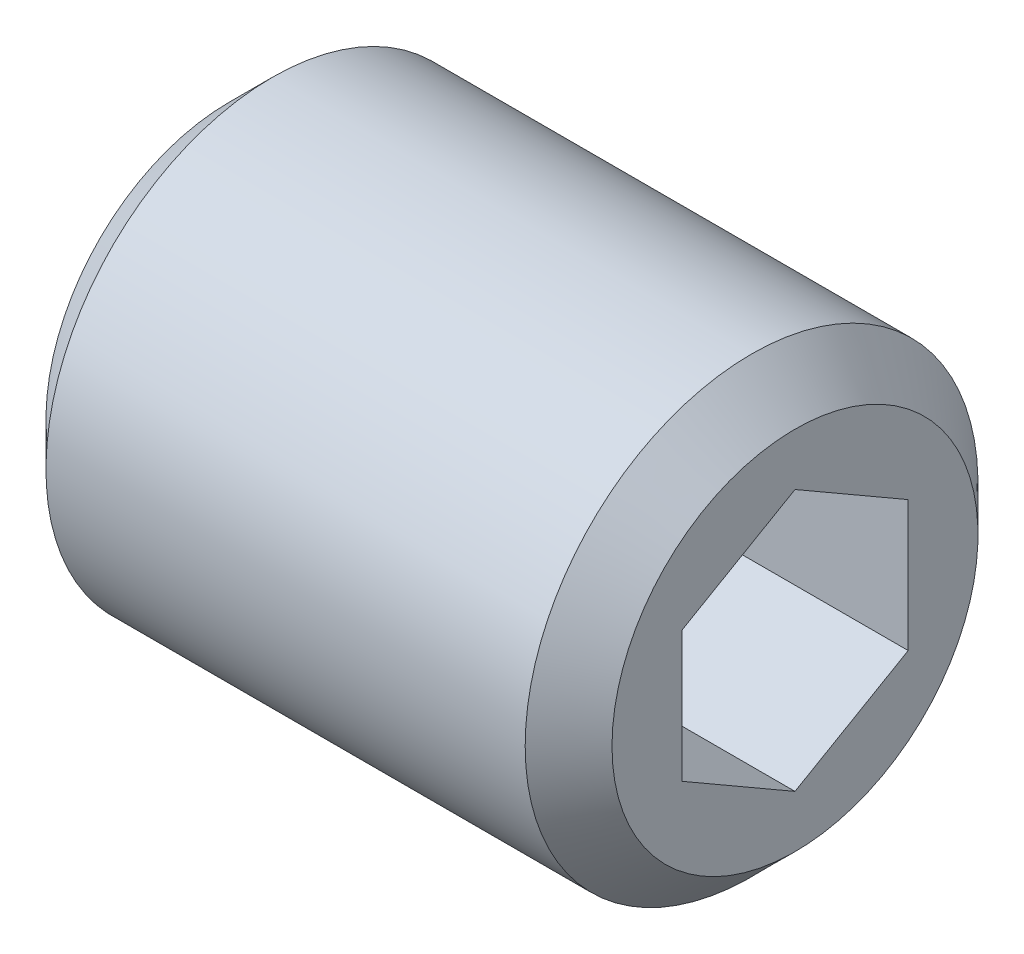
ISO-10303-21;
HEADER;
FILE_DESCRIPTION(('STEP AP214'),'2;1');
FILE_NAME('part.step','',(''),(''),'','','');
FILE_SCHEMA(('AUTOMOTIVE_DESIGN { 1 0 10303 214 1 1 1 1 }'));
ENDSEC;
DATA;
#1=APPLICATION_CONTEXT('core data for automotive mechanical design processes');
#2=APPLICATION_PROTOCOL_DEFINITION('international standard','automotive_design',2000,#1);
#3=PRODUCT_CONTEXT('',#1,'mechanical');
#4=PRODUCT('Part','Part','',(#3));
#5=PRODUCT_RELATED_PRODUCT_CATEGORY('part','',(#4));
#6=PRODUCT_DEFINITION_FORMATION('','',#4);
#7=PRODUCT_DEFINITION_CONTEXT('part definition',#1,'design');
#8=PRODUCT_DEFINITION('design','',#6,#7);
#9=PRODUCT_DEFINITION_SHAPE('','',#8);
#10=(LENGTH_UNIT() NAMED_UNIT(*) SI_UNIT(.MILLI.,.METRE.));
#11=(NAMED_UNIT(*) PLANE_ANGLE_UNIT() SI_UNIT($,.RADIAN.));
#12=(NAMED_UNIT(*) SI_UNIT($,.STERADIAN.) SOLID_ANGLE_UNIT());
#13=UNCERTAINTY_MEASURE_WITH_UNIT(LENGTH_MEASURE(1.E-05),#10,'distance_accuracy_value','');
#14=(GEOMETRIC_REPRESENTATION_CONTEXT(3) GLOBAL_UNCERTAINTY_ASSIGNED_CONTEXT((#13)) GLOBAL_UNIT_ASSIGNED_CONTEXT((#10,
#11,#12)) REPRESENTATION_CONTEXT('',''));
#15=CARTESIAN_POINT('',(0.,0.,0.));
#16=DIRECTION('',(0.,0.,1.));
#17=DIRECTION('',(1.,0.,0.));
#18=AXIS2_PLACEMENT_3D('',#15,#16,#17);
#19=CARTESIAN_POINT('',(5.00800000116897,0.,0.));
#20=DIRECTION('',(1.,0.,0.));
#21=DIRECTION('',(0.,0.,-1.));
#22=AXIS2_PLACEMENT_3D('',#19,#20,#21);
#23=CONICAL_SURFACE('',#22,2.32325748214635,1.04719754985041);
#24=CARTESIAN_POINT('',(3.66666666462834,-1.70530256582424E-10,0.));
#25=VERTEX_POINT('',#24);
#26=VERTEX_LOOP('',#25);
#27=FACE_BOUND('',#26,.T.);
#28=CARTESIAN_POINT('',(5.00000000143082,-1.15470053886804,1.99999999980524));
#29=CARTESIAN_POINT('',(4.97069554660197,-1.20544263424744,1.9121121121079));
#30=CARTESIAN_POINT('',(4.94404467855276,-1.25662273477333,1.82346557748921));
#31=CARTESIAN_POINT('',(4.897526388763,-1.35986908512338,1.64463765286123));
#32=CARTESIAN_POINT('',(4.87767542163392,-1.41193716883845,1.55445308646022));
#33=CARTESIAN_POINT('',(4.84677596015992,-1.51542808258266,1.3752015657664));
#34=CARTESIAN_POINT('',(4.83552178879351,-1.56683499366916,1.2861621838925));
#35=CARTESIAN_POINT('',(4.82208916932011,-1.66989057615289,1.10766467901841));
#36=CARTESIAN_POINT('',(4.81989959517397,-1.72153887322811,1.01820720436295));
#37=CARTESIAN_POINT('',(4.82446629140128,-1.81803817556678,0.851065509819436));
#38=CARTESIAN_POINT('',(4.83010128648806,-1.86290366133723,0.773356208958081));
#39=CARTESIAN_POINT('',(4.84795730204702,-1.95234234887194,0.618443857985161));
#40=CARTESIAN_POINT('',(4.86018441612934,-1.99691524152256,0.541241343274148));
#41=CARTESIAN_POINT('',(4.89074983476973,-2.08653818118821,0.386009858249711));
#42=CARTESIAN_POINT('',(4.90921764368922,-2.13157689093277,0.308000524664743));
#43=CARTESIAN_POINT('',(4.95113176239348,-2.22098275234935,0.153145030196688));
#44=CARTESIAN_POINT('',(4.97456823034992,-2.26535104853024,0.0762968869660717));
#45=CARTESIAN_POINT('',(5.00000000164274,-2.30940107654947,3.62011573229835E-10));
#46=B_SPLINE_CURVE_WITH_KNOTS('',3,(#28,#29,#30,#31,#32,#33,#34,#35,#36,#37,#38,#39,#40,#41,#42,
#43,#44,#45),.UNSPECIFIED.,.F.,.F.,(4,2,2,2,2,2,2,2,4),(0.,0.317016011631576,0.634793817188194,
0.944707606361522,1.25424088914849,1.5237077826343,1.7934241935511,2.06912162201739,
2.34427797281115),.UNSPECIFIED.);
#47=CARTESIAN_POINT('',(5.00000000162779,-1.15470053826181,1.99999999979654));
#48=VERTEX_POINT('',#47);
#49=CARTESIAN_POINT('',(5.0000000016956,-2.30940107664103,2.03426577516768E-10));
#50=VERTEX_POINT('',#49);
#51=EDGE_CURVE('E20',#48,#50,#46,.T.);
#52=ORIENTED_EDGE('',*,*,#51,.T.);
#53=CARTESIAN_POINT('',(5.00000000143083,-2.30940107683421,-5.20697314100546E-10));
#54=CARTESIAN_POINT('',(4.97069554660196,-2.25865898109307,-0.0878878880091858));
#55=CARTESIAN_POINT('',(4.94404467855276,-2.20747888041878,-0.176534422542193));
#56=CARTESIAN_POINT('',(4.89752638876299,-2.10423252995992,-0.355362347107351));
#57=CARTESIAN_POINT('',(4.87767542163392,-2.0521644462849,-0.445546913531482));
#58=CARTESIAN_POINT('',(4.84677596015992,-1.94867353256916,-0.624798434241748));
#59=CARTESIAN_POINT('',(4.83552178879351,-1.89726662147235,-0.71383781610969));
#60=CARTESIAN_POINT('',(4.82208916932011,-1.79421103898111,-0.892335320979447));
#61=CARTESIAN_POINT('',(4.81989959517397,-1.7425627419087,-0.981792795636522));
#62=CARTESIAN_POINT('',(4.82446629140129,-1.64606343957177,-1.14893449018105));
#63=CARTESIAN_POINT('',(4.83010128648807,-1.60119795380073,-1.22664379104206));
#64=CARTESIAN_POINT('',(4.84795730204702,-1.51175926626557,-1.38155614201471));
#65=CARTESIAN_POINT('',(4.86018441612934,-1.4671863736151,-1.45875865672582));
#66=CARTESIAN_POINT('',(4.89074983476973,-1.37756343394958,-1.61399014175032));
#67=CARTESIAN_POINT('',(4.90921764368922,-1.33252472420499,-1.69199947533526));
#68=CARTESIAN_POINT('',(4.95113176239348,-1.24311886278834,-1.84685496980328));
#69=CARTESIAN_POINT('',(4.97456823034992,-1.19875056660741,-1.92370311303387));
#70=CARTESIAN_POINT('',(5.00000000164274,-1.15470053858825,-1.99999999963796));
#71=B_SPLINE_CURVE_WITH_KNOTS('',3,(#53,#54,#55,#56,#57,#58,#59,#60,#61,#62,#63,#64,#65,#66,#67,
#68,#69,#70),.UNSPECIFIED.,.F.,.F.,(4,2,2,2,2,2,2,2,4),(0.,0.317016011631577,0.634793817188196,
0.944707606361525,1.2542408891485,1.5237077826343,1.7934241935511,2.06912162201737,
2.34427797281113),.UNSPECIFIED.);
#72=CARTESIAN_POINT('',(5.0000000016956,-1.15470053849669,-1.99999999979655));
#73=VERTEX_POINT('',#72);
#74=EDGE_CURVE('E110',#50,#73,#71,.T.);
#75=ORIENTED_EDGE('',*,*,#74,.T.);
#76=CARTESIAN_POINT('',(5.00000000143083,-1.15470053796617,-2.00000000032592));
#77=CARTESIAN_POINT('',(4.97069554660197,-1.05321634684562,-2.00000000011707));
#78=CARTESIAN_POINT('',(4.94404467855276,-0.950856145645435,-2.00000000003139));
#79=CARTESIAN_POINT('',(4.897526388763,-0.744363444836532,-1.99999999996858));
#80=CARTESIAN_POINT('',(4.87767542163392,-0.640227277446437,-1.9999999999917));
#81=CARTESIAN_POINT('',(4.84677596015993,-0.433245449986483,-2.00000000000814));
#82=CARTESIAN_POINT('',(4.83552178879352,-0.330431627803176,-2.00000000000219));
#83=CARTESIAN_POINT('',(4.82208916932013,-0.124320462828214,-1.99999999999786));
#84=CARTESIAN_POINT('',(4.81989959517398,-0.0210238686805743,-1.99999999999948));
#85=CARTESIAN_POINT('',(4.8244662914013,0.171974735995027,-2.00000000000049));
#86=CARTESIAN_POINT('',(4.83010128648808,0.261705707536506,-2.00000000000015));
#87=CARTESIAN_POINT('',(4.84795730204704,0.440583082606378,-1.9999999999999));
#88=CARTESIAN_POINT('',(4.86018441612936,0.529728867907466,-1.99999999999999));
#89=CARTESIAN_POINT('',(4.89074983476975,0.708974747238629,-2.00000000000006));
#90=CARTESIAN_POINT('',(4.90921764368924,0.799052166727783,-2.00000000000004));
#91=CARTESIAN_POINT('',(4.9511317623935,0.977863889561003,-2.));
#92=CARTESIAN_POINT('',(4.97456823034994,1.06660048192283,-1.99999999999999));
#93=CARTESIAN_POINT('',(5.00000000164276,1.15470053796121,-2.00000000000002));
#94=B_SPLINE_CURVE_WITH_KNOTS('',3,(#76,#77,#78,#79,#80,#81,#82,#83,#84,#85,#86,#87,#88,#89,#90,
#91,#92,#93),.UNSPECIFIED.,.F.,.F.,(4,2,2,2,2,2,2,2,4),(0.,0.317016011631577,0.634793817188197,
0.944707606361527,1.2542408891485,1.5237077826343,1.79342419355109,2.06912162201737,
2.34427797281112),.UNSPECIFIED.);
#95=CARTESIAN_POINT('',(5.00000000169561,1.15470053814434,-2.));
#96=VERTEX_POINT('',#95);
#97=EDGE_CURVE('E106',#73,#96,#94,.T.);
#98=ORIENTED_EDGE('',*,*,#97,.T.);
#99=CARTESIAN_POINT('',(5.00000000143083,1.15470053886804,-1.99999999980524));
#100=CARTESIAN_POINT('',(4.97069554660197,1.20544263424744,-1.9121121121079));
#101=CARTESIAN_POINT('',(4.94404467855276,1.25662273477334,-1.82346557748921));
#102=CARTESIAN_POINT('',(4.897526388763,1.35986908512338,-1.64463765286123));
#103=CARTESIAN_POINT('',(4.87767542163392,1.41193716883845,-1.55445308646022));
#104=CARTESIAN_POINT('',(4.84677596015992,1.51542808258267,-1.37520156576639));
#105=CARTESIAN_POINT('',(4.83552178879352,1.56683499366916,-1.2861621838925));
#106=CARTESIAN_POINT('',(4.82208916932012,1.66989057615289,-1.10766467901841));
#107=CARTESIAN_POINT('',(4.81989959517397,1.72153887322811,-1.01820720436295));
#108=CARTESIAN_POINT('',(4.82446629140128,1.81803817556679,-0.851065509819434));
#109=CARTESIAN_POINT('',(4.83010128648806,1.86290366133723,-0.773356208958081));
#110=CARTESIAN_POINT('',(4.84795730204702,1.95234234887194,-0.618443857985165));
#111=CARTESIAN_POINT('',(4.86018441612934,1.99691524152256,-0.541241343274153));
#112=CARTESIAN_POINT('',(4.89074983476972,2.0865381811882,-0.38600985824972));
#113=CARTESIAN_POINT('',(4.90921764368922,2.13157689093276,-0.308000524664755));
#114=CARTESIAN_POINT('',(4.95113176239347,2.22098275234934,-0.153145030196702));
#115=CARTESIAN_POINT('',(4.97456823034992,2.26535104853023,-0.0762968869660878));
#116=CARTESIAN_POINT('',(5.00000000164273,2.30940107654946,-3.62029486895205E-10));
#117=B_SPLINE_CURVE_WITH_KNOTS('',3,(#99,#100,#101,#102,#103,#104,#105,#106,#107,#108,#109,#110,
#111,#112,#113,#114,#115,#116),.UNSPECIFIED.,.F.,.F.,(4,2,2,2,2,2,2,2,4),(0.,0.317016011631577,
0.634793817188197,0.944707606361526,1.2542408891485,1.5237077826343,1.7934241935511,
2.06912162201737,2.34427797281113),.UNSPECIFIED.);
#118=CARTESIAN_POINT('',(5.0000000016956,2.30940107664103,-2.03453548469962E-10));
#119=VERTEX_POINT('',#118);
#120=EDGE_CURVE('E102',#96,#119,#117,.T.);
#121=ORIENTED_EDGE('',*,*,#120,.T.);
#122=CARTESIAN_POINT('',(5.00000000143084,2.30940107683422,5.20671836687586E-10));
#123=CARTESIAN_POINT('',(4.97069554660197,2.25865898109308,0.087887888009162));
#124=CARTESIAN_POINT('',(4.94404467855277,2.20747888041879,0.17653442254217));
#125=CARTESIAN_POINT('',(4.897526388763,2.10423252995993,0.35536234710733));
#126=CARTESIAN_POINT('',(4.87767542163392,2.05216444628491,0.445546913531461));
#127=CARTESIAN_POINT('',(4.84677596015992,1.94867353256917,0.624798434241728));
#128=CARTESIAN_POINT('',(4.83552178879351,1.89726662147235,0.71383781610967));
#129=CARTESIAN_POINT('',(4.82208916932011,1.79421103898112,0.892335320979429));
#130=CARTESIAN_POINT('',(4.81989959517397,1.7425627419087,0.981792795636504));
#131=CARTESIAN_POINT('',(4.82446629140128,1.64606343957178,1.14893449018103));
#132=CARTESIAN_POINT('',(4.83010128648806,1.60119795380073,1.22664379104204));
#133=CARTESIAN_POINT('',(4.84795730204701,1.51175926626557,1.3815561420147));
#134=CARTESIAN_POINT('',(4.86018441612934,1.4671863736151,1.45875865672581));
#135=CARTESIAN_POINT('',(4.89074983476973,1.37756343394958,1.61399014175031));
#136=CARTESIAN_POINT('',(4.90921764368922,1.33252472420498,1.69199947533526));
#137=CARTESIAN_POINT('',(4.95113176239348,1.24311886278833,1.84685496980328));
#138=CARTESIAN_POINT('',(4.97456823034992,1.1987505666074,1.92370311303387));
#139=CARTESIAN_POINT('',(5.00000000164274,1.15470053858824,1.99999999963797));
#140=B_SPLINE_CURVE_WITH_KNOTS('',3,(#122,#123,#124,#125,#126,#127,#128,#129,#130,#131,#132,
#133,#134,#135,#136,#137,#138,#139),.UNSPECIFIED.,.F.,.F.,(4,2,2,2,2,2,2,2,4),(0.,
0.317016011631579,0.634793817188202,0.944707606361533,1.25424088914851,1.52370778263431,
1.79342419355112,2.0691216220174,2.34427797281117),.UNSPECIFIED.);
#141=CARTESIAN_POINT('',(5.0000000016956,1.15470053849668,1.99999999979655));
#142=VERTEX_POINT('',#141);
#143=EDGE_CURVE('E85',#119,#142,#140,.T.);
#144=ORIENTED_EDGE('',*,*,#143,.T.);
#145=CARTESIAN_POINT('',(5.00000000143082,1.15470053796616,2.00000000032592));
#146=CARTESIAN_POINT('',(4.97069554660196,1.05321634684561,2.00000000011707));
#147=CARTESIAN_POINT('',(4.94404467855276,0.950856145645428,2.00000000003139));
#148=CARTESIAN_POINT('',(4.89752638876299,0.744363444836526,1.99999999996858));
#149=CARTESIAN_POINT('',(4.87767542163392,0.640227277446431,1.9999999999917));
#150=CARTESIAN_POINT('',(4.84677596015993,0.433245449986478,2.00000000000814));
#151=CARTESIAN_POINT('',(4.83552178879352,0.33043162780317,2.00000000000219));
#152=CARTESIAN_POINT('',(4.82208916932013,0.124320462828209,1.99999999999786));
#153=CARTESIAN_POINT('',(4.81989959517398,0.02102386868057,1.99999999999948));
#154=CARTESIAN_POINT('',(4.8244662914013,-0.171974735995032,2.00000000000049));
#155=CARTESIAN_POINT('',(4.83010128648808,-0.261705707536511,2.00000000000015));
#156=CARTESIAN_POINT('',(4.84795730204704,-0.440583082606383,1.9999999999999));
#157=CARTESIAN_POINT('',(4.86018441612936,-0.529728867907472,1.99999999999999));
#158=CARTESIAN_POINT('',(4.89074983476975,-0.708974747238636,2.00000000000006));
#159=CARTESIAN_POINT('',(4.90921764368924,-0.79905216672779,2.00000000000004));
#160=CARTESIAN_POINT('',(4.9511317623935,-0.97786388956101,2.));
#161=CARTESIAN_POINT('',(4.97456823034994,-1.06660048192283,1.99999999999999));
#162=CARTESIAN_POINT('',(5.00000000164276,-1.15470053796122,2.00000000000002));
#163=B_SPLINE_CURVE_WITH_KNOTS('',3,(#145,#146,#147,#148,#149,#150,#151,#152,#153,#154,#155,
#156,#157,#158,#159,#160,#161,#162),.UNSPECIFIED.,.F.,.F.,(4,2,2,2,2,2,2,2,4),(0.,
0.317016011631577,0.634793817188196,0.944707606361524,1.2542408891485,1.52370778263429,
1.79342419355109,2.06912162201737,2.34427797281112),.UNSPECIFIED.);
#164=EDGE_CURVE('E83',#142,#48,#163,.T.);
#165=ORIENTED_EDGE('',*,*,#164,.T.);
#166=EDGE_LOOP('',(#52,#75,#98,#121,#144,#165));
#167=FACE_BOUND('',#166,.T.);
#168=ADVANCED_FACE('F16',(#27,#167),#23,.F.);
#169=CARTESIAN_POINT('',(10.,-1.15470053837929,1.99999999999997));
#170=DIRECTION('',(0.,-0.866025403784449,0.499999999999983));
#171=DIRECTION('',(0.,-0.499999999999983,-0.866025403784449));
#172=AXIS2_PLACEMENT_3D('',#169,#170,#171);
#173=PLANE('',#172);
#174=DIRECTION('',(1.,0.,0.));
#175=VECTOR('',#174,1.);
#176=CARTESIAN_POINT('',(10.,-1.15470053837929,2.00000000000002));
#177=LINE('',#176,#175);
#178=CARTESIAN_POINT('',(10.,-1.15470053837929,2.00000000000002));
#179=VERTEX_POINT('',#178);
#180=EDGE_CURVE('E76',#48,#179,#177,.T.);
#181=ORIENTED_EDGE('',*,*,#180,.T.);
#182=DIRECTION('',(0.,-0.499999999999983,-0.866025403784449));
#183=VECTOR('',#182,1.);
#184=CARTESIAN_POINT('',(10.,-1.15470053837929,1.99999999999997));
#185=LINE('',#184,#183);
#186=CARTESIAN_POINT('',(10.,-2.3094010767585,0.));
#187=VERTEX_POINT('',#186);
#188=EDGE_CURVE('E87',#179,#187,#185,.T.);
#189=ORIENTED_EDGE('',*,*,#188,.T.);
#190=DIRECTION('',(1.,0.,0.));
#191=VECTOR('',#190,1.);
#192=CARTESIAN_POINT('',(10.,-2.3094010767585,0.));
#193=LINE('',#192,#191);
#194=EDGE_CURVE('E79',#187,#50,#193,.F.);
#195=ORIENTED_EDGE('',*,*,#194,.T.);
#196=ORIENTED_EDGE('',*,*,#51,.F.);
#197=EDGE_LOOP('',(#181,#189,#195,#196));
#198=FACE_BOUND('',#197,.T.);
#199=ADVANCED_FACE('F74',(#198),#173,.F.);
#200=CARTESIAN_POINT('',(10.,-2.3094010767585,0.));
#201=DIRECTION('',(0.,-0.866025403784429,-0.500000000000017));
#202=DIRECTION('',(0.,0.500000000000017,-0.866025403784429));
#203=AXIS2_PLACEMENT_3D('',#200,#201,#202);
#204=PLANE('',#203);
#205=ORIENTED_EDGE('',*,*,#194,.F.);
#206=DIRECTION('',(0.,0.500000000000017,-0.866025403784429));
#207=VECTOR('',#206,1.);
#208=CARTESIAN_POINT('',(10.,-2.3094010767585,0.));
#209=LINE('',#208,#207);
#210=CARTESIAN_POINT('',(10.,-1.15470053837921,-2.00000000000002));
#211=VERTEX_POINT('',#210);
#212=EDGE_CURVE('E117',#187,#211,#209,.T.);
#213=ORIENTED_EDGE('',*,*,#212,.T.);
#214=DIRECTION('',(-1.,0.,0.));
#215=VECTOR('',#214,1.);
#216=CARTESIAN_POINT('',(10.,-1.15470053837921,-2.00000000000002));
#217=LINE('',#216,#215);
#218=EDGE_CURVE('E107',#211,#73,#217,.T.);
#219=ORIENTED_EDGE('',*,*,#218,.T.);
#220=ORIENTED_EDGE('',*,*,#74,.F.);
#221=EDGE_LOOP('',(#205,#213,#219,#220));
#222=FACE_BOUND('',#221,.T.);
#223=ADVANCED_FACE('F162',(#222),#204,.F.);
#224=CARTESIAN_POINT('',(10.,-1.15470053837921,-2.00000000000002));
#225=DIRECTION('',(0.,0.,-1.));
#226=DIRECTION('',(-1.,0.,0.));
#227=AXIS2_PLACEMENT_3D('',#224,#225,#226);
#228=PLANE('',#227);
#229=ORIENTED_EDGE('',*,*,#218,.F.);
#230=DIRECTION('',(0.,1.,0.));
#231=VECTOR('',#230,1.);
#232=CARTESIAN_POINT('',(10.,0.,-2.00000000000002));
#233=LINE('',#232,#231);
#234=CARTESIAN_POINT('',(10.,1.15470053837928,-1.99999999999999));
#235=VERTEX_POINT('',#234);
#236=EDGE_CURVE('E119',#211,#235,#233,.T.);
#237=ORIENTED_EDGE('',*,*,#236,.T.);
#238=DIRECTION('',(1.,0.,0.));
#239=VECTOR('',#238,1.);
#240=CARTESIAN_POINT('',(10.,1.15470053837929,-1.99999999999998));
#241=LINE('',#240,#239);
#242=EDGE_CURVE('E103',#235,#96,#241,.F.);
#243=ORIENTED_EDGE('',*,*,#242,.T.);
#244=ORIENTED_EDGE('',*,*,#97,.F.);
#245=EDGE_LOOP('',(#229,#237,#243,#244));
#246=FACE_BOUND('',#245,.T.);
#247=ADVANCED_FACE('F148',(#246),#228,.F.);
#248=CARTESIAN_POINT('',(10.,1.15470053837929,-1.99999999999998));
#249=DIRECTION('',(0.,0.866025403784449,-0.499999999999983));
#250=DIRECTION('',(0.,0.499999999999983,0.866025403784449));
#251=AXIS2_PLACEMENT_3D('',#248,#249,#250);
#252=PLANE('',#251);
#253=ORIENTED_EDGE('',*,*,#242,.F.);
#254=DIRECTION('',(0.,0.49999999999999,0.866025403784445));
#255=VECTOR('',#254,1.);
#256=CARTESIAN_POINT('',(10.,1.15470053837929,-1.99999999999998));
#257=LINE('',#256,#255);
#258=CARTESIAN_POINT('',(10.,2.30940107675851,0.));
#259=VERTEX_POINT('',#258);
#260=EDGE_CURVE('E113',#235,#259,#257,.T.);
#261=ORIENTED_EDGE('',*,*,#260,.T.);
#262=DIRECTION('',(1.,0.,0.));
#263=VECTOR('',#262,1.);
#264=CARTESIAN_POINT('',(10.,2.30940107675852,0.));
#265=LINE('',#264,#263);
#266=EDGE_CURVE('E96',#259,#119,#265,.F.);
#267=ORIENTED_EDGE('',*,*,#266,.T.);
#268=ORIENTED_EDGE('',*,*,#120,.F.);
#269=EDGE_LOOP('',(#253,#261,#267,#268));
#270=FACE_BOUND('',#269,.T.);
#271=ADVANCED_FACE('F144',(#270),#252,.F.);
#272=CARTESIAN_POINT('',(10.,2.3094010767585,0.));
#273=DIRECTION('',(0.,0.866025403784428,0.500000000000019));
#274=DIRECTION('',(0.,-0.500000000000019,0.866025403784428));
#275=AXIS2_PLACEMENT_3D('',#272,#273,#274);
#276=PLANE('',#275);
#277=ORIENTED_EDGE('',*,*,#266,.F.);
#278=DIRECTION('',(0.,-0.500000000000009,0.866025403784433));
#279=VECTOR('',#278,1.);
#280=CARTESIAN_POINT('',(10.,2.3094010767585,0.));
#281=LINE('',#280,#279);
#282=CARTESIAN_POINT('',(10.,1.15470053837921,2.00000000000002));
#283=VERTEX_POINT('',#282);
#284=EDGE_CURVE('E38',#259,#283,#281,.T.);
#285=ORIENTED_EDGE('',*,*,#284,.T.);
#286=DIRECTION('',(1.,0.,0.));
#287=VECTOR('',#286,1.);
#288=CARTESIAN_POINT('',(10.,1.15470053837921,2.00000000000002));
#289=LINE('',#288,#287);
#290=EDGE_CURVE('E88',#283,#142,#289,.F.);
#291=ORIENTED_EDGE('',*,*,#290,.T.);
#292=ORIENTED_EDGE('',*,*,#143,.F.);
#293=EDGE_LOOP('',(#277,#285,#291,#292));
#294=FACE_BOUND('',#293,.T.);
#295=ADVANCED_FACE('F139',(#294),#276,.F.);
#296=CARTESIAN_POINT('',(10.,1.15470053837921,2.00000000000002));
#297=DIRECTION('',(0.,0.,1.));
#298=DIRECTION('',(1.,0.,0.));
#299=AXIS2_PLACEMENT_3D('',#296,#297,#298);
#300=PLANE('',#299);
#301=ORIENTED_EDGE('',*,*,#290,.F.);
#302=DIRECTION('',(0.,1.,0.));
#303=VECTOR('',#302,1.);
#304=CARTESIAN_POINT('',(10.,0.,2.00000000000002));
#305=LINE('',#304,#303);
#306=EDGE_CURVE('E92',#283,#179,#305,.F.);
#307=ORIENTED_EDGE('',*,*,#306,.T.);
#308=ORIENTED_EDGE('',*,*,#180,.F.);
#309=ORIENTED_EDGE('',*,*,#164,.F.);
#310=EDGE_LOOP('',(#301,#307,#308,#309));
#311=FACE_BOUND('',#310,.T.);
#312=ADVANCED_FACE('F90',(#311),#300,.F.);
#313=CARTESIAN_POINT('',(10.,0.,0.));
#314=DIRECTION('',(-1.,0.,0.));
#315=DIRECTION('',(0.,0.,1.));
#316=AXIS2_PLACEMENT_3D('',#313,#314,#315);
#317=PLANE('',#316);
#318=ORIENTED_EDGE('',*,*,#284,.F.);
#319=ORIENTED_EDGE('',*,*,#260,.F.);
#320=ORIENTED_EDGE('',*,*,#236,.F.);
#321=ORIENTED_EDGE('',*,*,#212,.F.);
#322=ORIENTED_EDGE('',*,*,#188,.F.);
#323=ORIENTED_EDGE('',*,*,#306,.F.);
#324=EDGE_LOOP('',(#318,#319,#320,#321,#322,#323));
#325=FACE_BOUND('',#324,.T.);
#326=CARTESIAN_POINT('',(10.000000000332,0.,0.));
#327=DIRECTION('',(-1.,0.,0.));
#328=DIRECTION('',(0.,0.,1.));
#329=AXIS2_PLACEMENT_3D('',#326,#327,#328);
#330=CIRCLE('',#329,3.23318750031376);
#331=CARTESIAN_POINT('',(10.000000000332,0.,3.23318750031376));
#332=VERTEX_POINT('',#331);
#333=EDGE_CURVE('E115',#332,#332,#330,.T.);
#334=ORIENTED_EDGE('',*,*,#333,.F.);
#335=EDGE_LOOP('',(#334));
#336=FACE_BOUND('',#335,.T.);
#337=ADVANCED_FACE('F138',(#325,#336),#317,.F.);
#338=CARTESIAN_POINT('',(0.,2.,0.));
#339=DIRECTION('',(-1.,0.,0.));
#340=DIRECTION('',(0.,0.,1.));
#341=AXIS2_PLACEMENT_3D('',#338,#339,#340);
#342=PLANE('',#341);
#343=CARTESIAN_POINT('',(-3.97904040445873E-10,0.,0.));
#344=DIRECTION('',(1.,0.,0.));
#345=DIRECTION('',(0.,1.,0.));
#346=AXIS2_PLACEMENT_3D('',#343,#344,#345);
#347=CIRCLE('',#346,3.23318750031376);
#348=CARTESIAN_POINT('',(-3.97904171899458E-10,3.23318750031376,0.));
#349=VERTEX_POINT('',#348);
#350=EDGE_CURVE('E122',#349,#349,#347,.T.);
#351=ORIENTED_EDGE('',*,*,#350,.F.);
#352=EDGE_LOOP('',(#351));
#353=FACE_BOUND('',#352,.T.);
#354=ADVANCED_FACE('F187',(#353),#342,.T.);
#355=CARTESIAN_POINT('',(9.23318749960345,0.,0.));
#356=DIRECTION('',(-1.,0.,0.));
#357=DIRECTION('',(0.,0.,1.));
#358=AXIS2_PLACEMENT_3D('',#355,#356,#357);
#359=CONICAL_SURFACE('',#358,3.99999999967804,0.785398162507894);
#360=ORIENTED_EDGE('',*,*,#333,.T.);
#361=EDGE_LOOP('',(#360));
#362=FACE_BOUND('',#361,.T.);
#363=CARTESIAN_POINT('',(9.2331875,0.,0.));
#364=DIRECTION('',(1.,0.,0.));
#365=DIRECTION('',(0.,1.,0.));
#366=AXIS2_PLACEMENT_3D('',#363,#364,#365);
#367=CIRCLE('',#366,4.);
#368=CARTESIAN_POINT('',(9.2331875,4.,0.));
#369=VERTEX_POINT('',#368);
#370=EDGE_CURVE('E29',#369,#369,#367,.F.);
#371=ORIENTED_EDGE('',*,*,#370,.F.);
#372=EDGE_LOOP('',(#371));
#373=FACE_BOUND('',#372,.T.);
#374=ADVANCED_FACE('F181',(#362,#373),#359,.T.);
#375=CARTESIAN_POINT('',(0.766812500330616,0.,0.));
#376=DIRECTION('',(1.,0.,0.));
#377=DIRECTION('',(0.,1.,0.));
#378=AXIS2_PLACEMENT_3D('',#375,#376,#377);
#379=CONICAL_SURFACE('',#378,3.99999999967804,0.785398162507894);
#380=CARTESIAN_POINT('',(0.7668125,0.,0.));
#381=DIRECTION('',(1.,0.,0.));
#382=DIRECTION('',(0.,1.,0.));
#383=AXIS2_PLACEMENT_3D('',#380,#381,#382);
#384=CIRCLE('',#383,4.);
#385=CARTESIAN_POINT('',(0.7668125,4.,0.));
#386=VERTEX_POINT('',#385);
#387=EDGE_CURVE('E11',#386,#386,#384,.T.);
#388=ORIENTED_EDGE('',*,*,#387,.F.);
#389=EDGE_LOOP('',(#388));
#390=FACE_BOUND('',#389,.T.);
#391=ORIENTED_EDGE('',*,*,#350,.T.);
#392=EDGE_LOOP('',(#391));
#393=FACE_BOUND('',#392,.T.);
#394=ADVANCED_FACE('F175',(#390,#393),#379,.T.);
#395=CARTESIAN_POINT('',(5.,0.,0.));
#396=DIRECTION('',(1.,0.,0.));
#397=DIRECTION('',(0.,1.,0.));
#398=AXIS2_PLACEMENT_3D('',#395,#396,#397);
#399=CYLINDRICAL_SURFACE('',#398,4.);
#400=ORIENTED_EDGE('',*,*,#387,.T.);
#401=EDGE_LOOP('',(#400));
#402=FACE_BOUND('',#401,.T.);
#403=ORIENTED_EDGE('',*,*,#370,.T.);
#404=EDGE_LOOP('',(#403));
#405=FACE_BOUND('',#404,.T.);
#406=ADVANCED_FACE('F173',(#402,#405),#399,.T.);
#407=CLOSED_SHELL('',(#168,#199,#223,#247,#271,#295,#312,#337,#354,#374,#394,#406));
#408=MANIFOLD_SOLID_BREP('B1',#407);
#409=ADVANCED_BREP_SHAPE_REPRESENTATION('',(#18,#408),#14);
#410=SHAPE_DEFINITION_REPRESENTATION(#9,#409);
ENDSEC;
END-ISO-10303-21;
